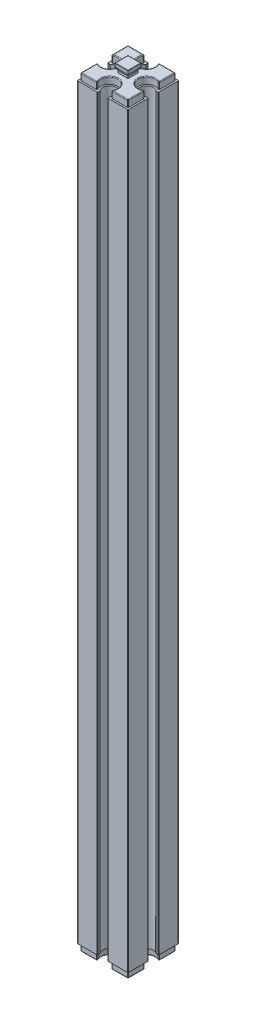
from build123d import *

# Parameters (mm, degrees)
EXTRUDE_1_DEPTH        = 110.5
EXTRUDE_2_DEPTH        = 2
EXTRUDE_START          = -2
EXTRUDE_3_DEPTH        = 4
FILLET_3_R             = 0.2
CUT_EXTRUDE_1_DEPTH    = 3
FILLET_4_R             = 0.2
FILLET_5_R             = 0.1
FILLET_3_OF_MIRROR_1_R = 0.2
FILLET_4_OF_MIRROR_1_R = 0.2
FILLET_5_OF_MIRROR_1_R = 0.1


with BuildPart() as part:
    # Sketch 1 → Extrude 1 (new body)
    with BuildSketch(Plane(origin=(0, 0, 0), x_dir=(1, 0, 0), z_dir=(0, 1, 0))):
        with BuildLine():
            Line((-7.5, 7.5), (-1.5, 7.5))
            Line((-1.5, 7.5), (-1.5, 6.822875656))
            ThreePointArc((-1.5, 6.822875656), (0, 3.5), (1.5, 6.822875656))
            Line((1.5, 6.822875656), (1.5, 7.5))
            Line((1.5, 7.5), (7.5, 7.5))
            Line((7.5, 7.5), (7.5, 1.5))
            Line((7.5, 1.5), (6.822875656, 1.5))
            ThreePointArc((6.822875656, 1.5), (3.5, 0), (6.822875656, -1.5))
            Line((6.822875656, -1.5), (7.5, -1.5))
            Line((7.5, -1.5), (7.5, -7.5))
            Line((7.5, -7.5), (1.5, -7.5))
            Line((1.5, -7.5), (1.5, -6.822875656))
            ThreePointArc((1.5, -6.822875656), (0, -3.5), (-1.5, -6.822875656))
            Line((-1.5, -6.822875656), (-1.5, -7.5))
            Line((-1.5, -7.5), (-7.5, -7.5))
            Line((-7.5, -7.5), (-7.5, -1.5))
            Line((-7.5, -1.5), (-6.822875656, -1.5))
            ThreePointArc((-6.822875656, -1.5), (-3.5, 0), (-6.822875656, 1.5))
            Line((-6.822875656, 1.5), (-7.5, 1.5))
            Line((-7.5, 1.5), (-7.5, 7.5))
        make_face()
    extrude_1 = extrude(amount=EXTRUDE_1_DEPTH)

    # Sketch 2 → Extrude 2 (add)
    with BuildSketch(Plane(origin=(0, 110.5, 0), x_dir=(1, 0, 0), z_dir=(0, 1, 0))):
        with BuildLine():
            Line((-7, 7), (-7, 2))
            ThreePointArc((-7, 2), (-3, 0), (-7, -2))
            Line((-7, -2), (-7, -7))
            Line((-7, -7), (-2, -7))
            ThreePointArc((-2, -7), (0, -3), (2, -7))
            Line((2, -7), (7, -7))
            Line((7, -7), (7, -2))
            ThreePointArc((7, -2), (3, 0), (7, 2))
            Line((7, 2), (7, 7))
            Line((7, 7), (2, 7))
            ThreePointArc((2, 7), (0, 3), (-2, 7))
            Line((-2, 7), (-7, 7))
        make_face()
    extrude_2 = extrude(amount=EXTRUDE_2_DEPTH)

    # Sketch 3 → Extrude 3 (add)
    with BuildSketch(Plane(origin=(0, 0, 0), x_dir=(0, 0, -1), z_dir=(1, 0, 0)).offset(EXTRUDE_START)):
        with BuildLine():
            Line((-1.5, 112.5), (1.5, 112.5))
            Line((1.5, 112.5), (1.5, 113.177124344))
            ThreePointArc((1.5, 113.177124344), (1.780042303, 113.588161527), (1.95, 114.055590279))
            Line((1.95, 114.055590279), (1.95, 115))
            Line((1.95, 115), (-1.95, 115))
            Line((-1.95, 115), (-1.95, 114.055590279))
            ThreePointArc((-1.95, 114.055590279), (-1.780042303, 113.588161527), (-1.5, 113.177124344))
            Line((-1.5, 113.177124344), (-1.5, 112.5))
        make_face()
    extrude_3 = extrude(amount=EXTRUDE_3_DEPTH)

    # Fillet 3
    fillet_3_edges = [part.edges().sort_by_distance(p)[0] for p in [
        (-7.5, 55.25, -7.5),
        (-1.5, 55.25, -7.5),
        (1.5, 55.25, -7.5),
        (7.5, 55.25, -7.5),
        (7.5, 55.25, -1.5),
        (7.5, 55.25, 1.5),
        (7.5, 55.25, 7.5),
        (1.5, 55.25, 7.5),
        (-1.5, 55.25, 7.5),
        (-7.5, 55.25, 7.5),
        (-7.5, 55.25, 1.5),
        (-6.822875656, 55.25, -1.5),
        (-7.5, 55.25, -1.5),
    ]]
    fillet(fillet_3_edges, radius=FILLET_3_R)

    # Sketch 4 → Cut-Extrude 1 (cut, symmetric)
    with BuildSketch(Plane.XY):
        with BuildLine():
            Line((1.95, 115), (2, 115))
            Line((2, 115), (2, 112.5))
            Line((2, 112.5), (1.5, 112.5))
            Line((1.5, 112.5), (1.5, 113.177124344))
            ThreePointArc((1.5, 113.177124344), (1.780042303, 113.588161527), (1.95, 114.055590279))
            Line((1.95, 114.055590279), (1.95, 115))
        make_face()
        with BuildLine():
            Line((-1.95, 115), (-1.95, 114.055590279))
            ThreePointArc((-1.95, 114.055590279), (-1.780042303, 113.588161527), (-1.5, 113.177124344))
            Line((-1.5, 113.177124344), (-1.5, 112.5))
            Line((-1.5, 112.5), (-2, 112.5))
            Line((-2, 112.5), (-2, 115))
            Line((-2, 115), (-1.95, 115))
        make_face()
    cut_extrude_1 = extrude(amount=CUT_EXTRUDE_1_DEPTH, both=True, mode=Mode.SUBTRACT)

    # Fillet 4
    fillet_4_edges = [part.edges().sort_by_distance(p)[0] for p in [
        (-2, 111.5, -7),
        (-7, 111.5, -7),
        (-7, 111.5, -2),
        (-7, 111.5, 2),
        (-7, 111.5, 7),
        (-2, 111.5, 7),
        (2, 111.5, 7),
        (7, 111.5, 7),
        (7, 111.5, 2),
        (7, 111.5, -2),
        (7, 111.5, -7),
        (2, 111.5, -7),
        (-4.5, 112.5, -7),
        (-7, 112.5, -4.5),
        (-3, 112.5, 0),
        (-7, 112.5, 4.5),
        (-4.5, 112.5, 7),
        (0, 112.5, 3),
        (4.5, 112.5, 7),
        (7, 112.5, 4.5),
        (3, 112.5, 0),
        (7, 112.5, -4.5),
        (4.5, 112.5, -7),
        (0, 112.5, -3),
    ]]
    fillet(fillet_4_edges, radius=FILLET_4_R)

    # Fillet 5
    fillet_5_edges = [part.edges().sort_by_distance(p)[0] for p in [
        (1.95, 115, 0),
        (0, 115, -1.95),
        (0, 115, 1.95),
        (-1.95, 115, 0),
    ]]
    fillet(fillet_5_edges, radius=FILLET_5_R)

    # Mirror 1: Extrude 1, Extrude 2, Extrude 3, Cut-Extrude 1 across Top Plane
    add(extrude_1.mirror(Plane(origin=(0, 0, 0), x_dir=(1, 0, 0), z_dir=(0, 1, 0))))
    add(extrude_2.mirror(Plane(origin=(0, 0, 0), x_dir=(1, 0, 0), z_dir=(0, 1, 0))))
    add(extrude_3.mirror(Plane(origin=(0, 0, 0), x_dir=(1, 0, 0), z_dir=(0, 1, 0))))
    add(cut_extrude_1.mirror(Plane(origin=(0, 0, 0), x_dir=(1, 0, 0), z_dir=(0, 1, 0))), mode=Mode.SUBTRACT)

    # Fillet 3 of Mirror 1
    fillet_3_of_mirror_1_edges = [part.edges().sort_by_distance(p)[0] for p in [
        (-7.5, -55.25, -7.5),
        (-1.5, -55.25, -7.5),
        (1.5, -55.25, -7.5),
        (7.5, -55.25, -7.5),
        (7.5, -55.25, -1.5),
        (7.5, -55.25, 1.5),
        (7.5, -55.25, 7.5),
        (1.5, -55.25, 7.5),
        (-1.5, -55.25, 7.5),
        (-7.5, -55.25, 7.5),
        (-7.5, -55.25, 1.5),
        (-6.822875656, -55.25, -1.5),
        (-7.5, -55.25, -1.5),
    ]]
    fillet(fillet_3_of_mirror_1_edges, radius=FILLET_3_OF_MIRROR_1_R)

    # Fillet 4 of Mirror 1
    fillet_4_of_mirror_1_edges = [part.edges().sort_by_distance(p)[0] for p in [
        (-2, -111.5, -7),
        (-7, -111.5, -7),
        (-7, -111.5, -2),
        (-7, -111.5, 2),
        (-7, -111.5, 7),
        (-2, -111.5, 7),
        (2, -111.5, 7),
        (7, -111.5, 7),
        (7, -111.5, 2),
        (7, -111.5, -2),
        (7, -111.5, -7),
        (2, -111.5, -7),
        (-4.5, -112.5, -7),
        (-7, -112.5, -4.5),
        (-3, -112.5, 0),
        (-7, -112.5, 4.5),
        (-4.5, -112.5, 7),
        (0, -112.5, 3),
        (4.5, -112.5, 7),
        (7, -112.5, 4.5),
        (3, -112.5, 0),
        (7, -112.5, -4.5),
        (4.5, -112.5, -7),
        (0, -112.5, -3),
    ]]
    fillet(fillet_4_of_mirror_1_edges, radius=FILLET_4_OF_MIRROR_1_R)

    # Fillet 5 of Mirror 1
    fillet_5_of_mirror_1_edges = [part.edges().sort_by_distance(p)[0] for p in [
        (1.95, -115, 0),
        (0, -115, -1.95),
        (0, -115, 1.95),
        (-1.95, -115, 0),
    ]]
    fillet(fillet_5_of_mirror_1_edges, radius=FILLET_5_OF_MIRROR_1_R)


solid = part.part
